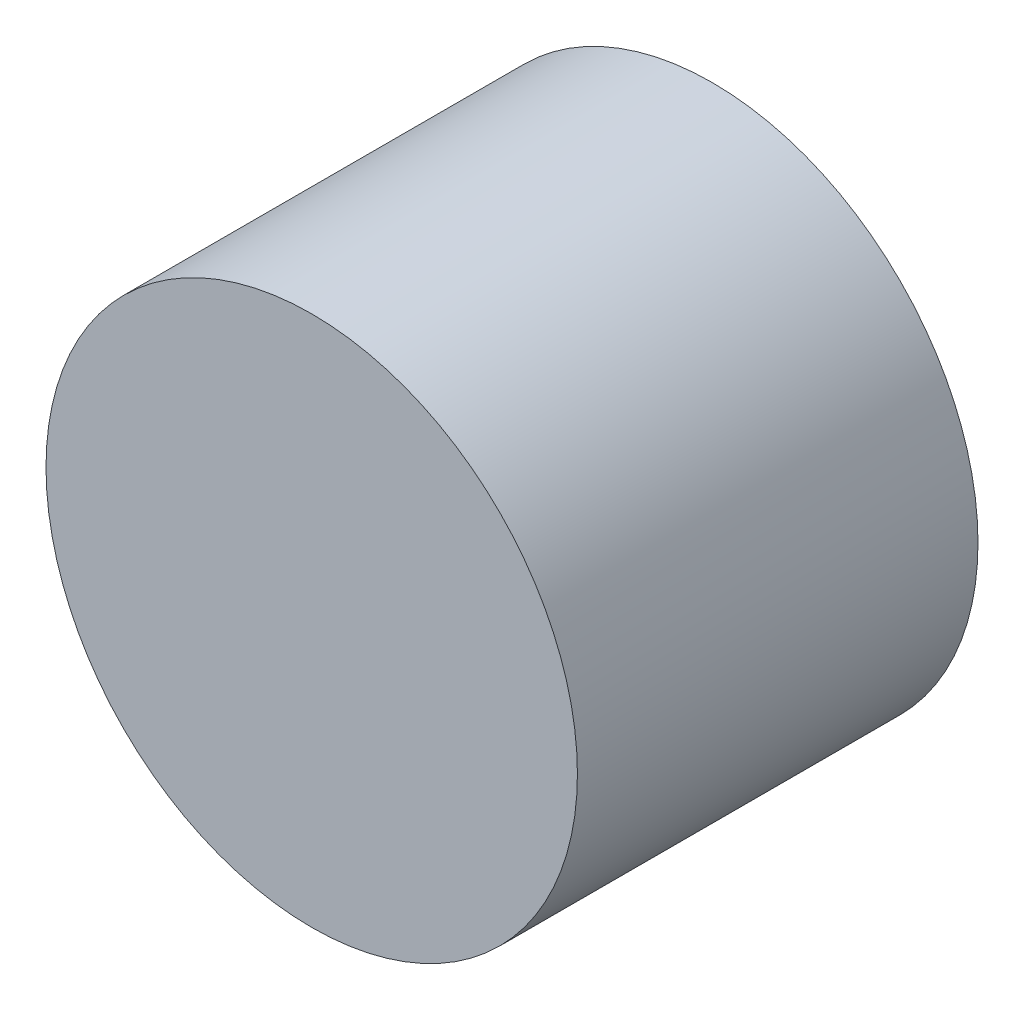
ISO-10303-21;
HEADER;
FILE_DESCRIPTION(('STEP AP214'),'2;1');
FILE_NAME('part.step','',(''),(''),'','','');
FILE_SCHEMA(('AUTOMOTIVE_DESIGN { 1 0 10303 214 1 1 1 1 }'));
ENDSEC;
DATA;
#1=APPLICATION_CONTEXT('core data for automotive mechanical design processes');
#2=APPLICATION_PROTOCOL_DEFINITION('international standard','automotive_design',2000,#1);
#3=PRODUCT_CONTEXT('',#1,'mechanical');
#4=PRODUCT('Part','Part','',(#3));
#5=PRODUCT_RELATED_PRODUCT_CATEGORY('part','',(#4));
#6=PRODUCT_DEFINITION_FORMATION('','',#4);
#7=PRODUCT_DEFINITION_CONTEXT('part definition',#1,'design');
#8=PRODUCT_DEFINITION('design','',#6,#7);
#9=PRODUCT_DEFINITION_SHAPE('','',#8);
#10=(LENGTH_UNIT() NAMED_UNIT(*) SI_UNIT(.MILLI.,.METRE.));
#11=(NAMED_UNIT(*) PLANE_ANGLE_UNIT() SI_UNIT($,.RADIAN.));
#12=(NAMED_UNIT(*) SI_UNIT($,.STERADIAN.) SOLID_ANGLE_UNIT());
#13=UNCERTAINTY_MEASURE_WITH_UNIT(LENGTH_MEASURE(1.E-05),#10,'distance_accuracy_value','');
#14=(GEOMETRIC_REPRESENTATION_CONTEXT(3) GLOBAL_UNCERTAINTY_ASSIGNED_CONTEXT((#13)) GLOBAL_UNIT_ASSIGNED_CONTEXT((#10,
#11,#12)) REPRESENTATION_CONTEXT('',''));
#15=CARTESIAN_POINT('',(0.,0.,0.));
#16=DIRECTION('',(0.,0.,1.));
#17=DIRECTION('',(1.,0.,0.));
#18=AXIS2_PLACEMENT_3D('',#15,#16,#17);
#19=CARTESIAN_POINT('',(0.,0.,3.));
#20=DIRECTION('',(0.,0.,-1.));
#21=DIRECTION('',(-1.,0.,0.));
#22=AXIS2_PLACEMENT_3D('',#19,#20,#21);
#23=CYLINDRICAL_SURFACE('',#22,1.99);
#24=CARTESIAN_POINT('',(0.,0.,3.));
#25=DIRECTION('',(0.,0.,1.));
#26=DIRECTION('',(1.,0.,0.));
#27=AXIS2_PLACEMENT_3D('',#24,#25,#26);
#28=CIRCLE('',#27,1.99);
#29=CARTESIAN_POINT('',(1.99,0.,3.));
#30=VERTEX_POINT('',#29);
#31=EDGE_CURVE('E10',#30,#30,#28,.T.);
#32=ORIENTED_EDGE('',*,*,#31,.F.);
#33=EDGE_LOOP('',(#32));
#34=FACE_BOUND('',#33,.T.);
#35=CARTESIAN_POINT('',(0.,0.,0.));
#36=DIRECTION('',(0.,0.,1.));
#37=DIRECTION('',(1.,0.,0.));
#38=AXIS2_PLACEMENT_3D('',#35,#36,#37);
#39=CIRCLE('',#38,1.99);
#40=CARTESIAN_POINT('',(1.99,0.,0.));
#41=VERTEX_POINT('',#40);
#42=EDGE_CURVE('E34',#41,#41,#39,.T.);
#43=ORIENTED_EDGE('',*,*,#42,.T.);
#44=EDGE_LOOP('',(#43));
#45=FACE_BOUND('',#44,.T.);
#46=ADVANCED_FACE('F31',(#34,#45),#23,.T.);
#47=CARTESIAN_POINT('',(0.,0.,3.));
#48=DIRECTION('',(0.,0.,1.));
#49=DIRECTION('',(1.,0.,0.));
#50=AXIS2_PLACEMENT_3D('',#47,#48,#49);
#51=PLANE('',#50);
#52=ORIENTED_EDGE('',*,*,#31,.T.);
#53=EDGE_LOOP('',(#52));
#54=FACE_BOUND('',#53,.T.);
#55=ADVANCED_FACE('F46',(#54),#51,.T.);
#56=CARTESIAN_POINT('',(0.,0.,0.));
#57=DIRECTION('',(0.,0.,1.));
#58=DIRECTION('',(1.,0.,0.));
#59=AXIS2_PLACEMENT_3D('',#56,#57,#58);
#60=PLANE('',#59);
#61=ORIENTED_EDGE('',*,*,#42,.F.);
#62=EDGE_LOOP('',(#61));
#63=FACE_BOUND('',#62,.T.);
#64=ADVANCED_FACE('F44',(#63),#60,.F.);
#65=CLOSED_SHELL('',(#46,#55,#64));
#66=MANIFOLD_SOLID_BREP('B2',#65);
#67=ADVANCED_BREP_SHAPE_REPRESENTATION('',(#18,#66),#14);
#68=SHAPE_DEFINITION_REPRESENTATION(#9,#67);
ENDSEC;
END-ISO-10303-21;
